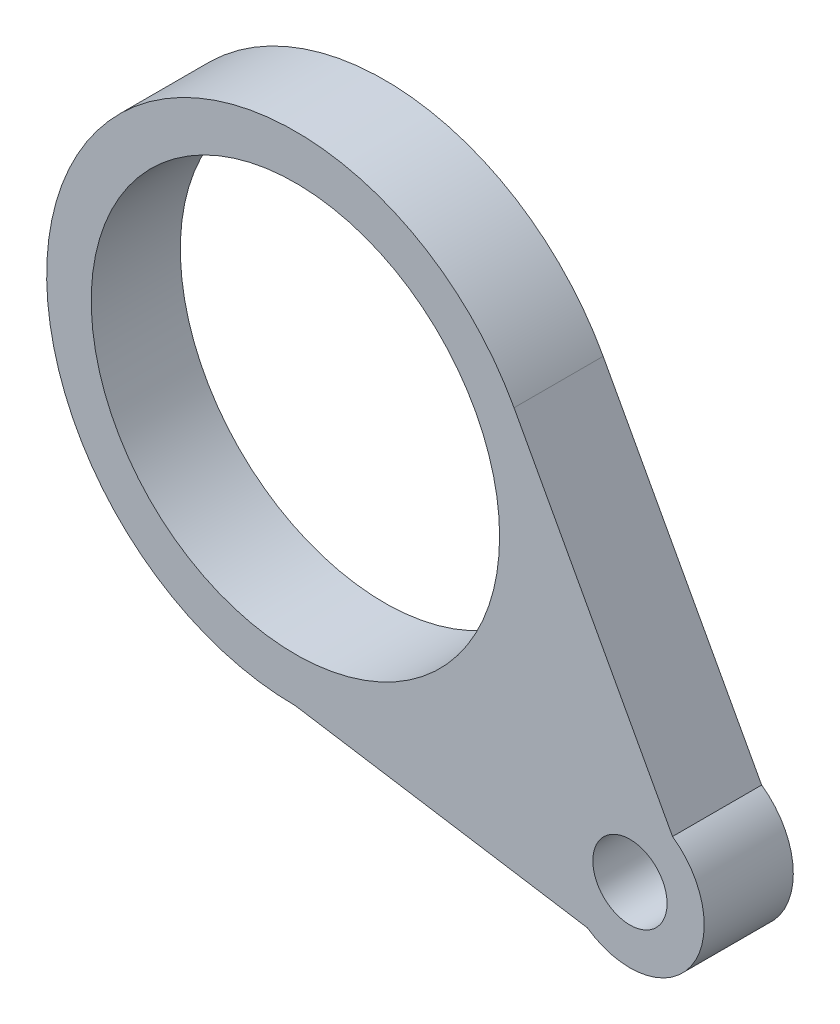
ISO-10303-21;
HEADER;
FILE_DESCRIPTION(('STEP AP214'),'2;1');
FILE_NAME('part.step','',(''),(''),'','','');
FILE_SCHEMA(('AUTOMOTIVE_DESIGN { 1 0 10303 214 1 1 1 1 }'));
ENDSEC;
DATA;
#1=APPLICATION_CONTEXT('core data for automotive mechanical design processes');
#2=APPLICATION_PROTOCOL_DEFINITION('international standard','automotive_design',2000,#1);
#3=PRODUCT_CONTEXT('',#1,'mechanical');
#4=PRODUCT('Part','Part','',(#3));
#5=PRODUCT_RELATED_PRODUCT_CATEGORY('part','',(#4));
#6=PRODUCT_DEFINITION_FORMATION('','',#4);
#7=PRODUCT_DEFINITION_CONTEXT('part definition',#1,'design');
#8=PRODUCT_DEFINITION('design','',#6,#7);
#9=PRODUCT_DEFINITION_SHAPE('','',#8);
#10=(LENGTH_UNIT() NAMED_UNIT(*) SI_UNIT(.MILLI.,.METRE.));
#11=(NAMED_UNIT(*) PLANE_ANGLE_UNIT() SI_UNIT($,.RADIAN.));
#12=(NAMED_UNIT(*) SI_UNIT($,.STERADIAN.) SOLID_ANGLE_UNIT());
#13=UNCERTAINTY_MEASURE_WITH_UNIT(LENGTH_MEASURE(1.E-05),#10,'distance_accuracy_value','');
#14=(GEOMETRIC_REPRESENTATION_CONTEXT(3) GLOBAL_UNCERTAINTY_ASSIGNED_CONTEXT((#13)) GLOBAL_UNIT_ASSIGNED_CONTEXT((#10,
#11,#12)) REPRESENTATION_CONTEXT('',''));
#15=CARTESIAN_POINT('',(0.,0.,0.));
#16=DIRECTION('',(0.,0.,1.));
#17=DIRECTION('',(1.,0.,0.));
#18=AXIS2_PLACEMENT_3D('',#15,#16,#17);
#19=CARTESIAN_POINT('',(0.,0.,12.));
#20=DIRECTION('',(0.,0.,-1.));
#21=DIRECTION('',(-1.,0.,0.));
#22=AXIS2_PLACEMENT_3D('',#19,#20,#21);
#23=CYLINDRICAL_SURFACE('',#22,33.5);
#24=CARTESIAN_POINT('',(0.,0.,0.));
#25=DIRECTION('',(0.,0.,1.));
#26=DIRECTION('',(1.,0.,0.));
#27=AXIS2_PLACEMENT_3D('',#24,#25,#26);
#28=CIRCLE('',#27,33.5);
#29=CARTESIAN_POINT('',(29.4438643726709,15.9783869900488,0.));
#30=VERTEX_POINT('',#29);
#31=CARTESIAN_POINT('',(0.,-33.5,0.));
#32=VERTEX_POINT('',#31);
#33=EDGE_CURVE('E125',#30,#32,#28,.T.);
#34=ORIENTED_EDGE('',*,*,#33,.T.);
#35=DIRECTION('',(0.,0.,-1.));
#36=VECTOR('',#35,1.);
#37=CARTESIAN_POINT('',(0.,-33.5,12.));
#38=LINE('',#37,#36);
#39=CARTESIAN_POINT('',(0.,-33.5,12.));
#40=VERTEX_POINT('',#39);
#41=EDGE_CURVE('E51',#40,#32,#38,.T.);
#42=ORIENTED_EDGE('',*,*,#41,.F.);
#43=CARTESIAN_POINT('',(0.,0.,12.));
#44=DIRECTION('',(0.,0.,1.));
#45=DIRECTION('',(1.,0.,0.));
#46=AXIS2_PLACEMENT_3D('',#43,#44,#45);
#47=CIRCLE('',#46,33.5);
#48=CARTESIAN_POINT('',(29.4438643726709,15.9783869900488,12.));
#49=VERTEX_POINT('',#48);
#50=EDGE_CURVE('E86',#49,#40,#47,.T.);
#51=ORIENTED_EDGE('',*,*,#50,.F.);
#52=DIRECTION('',(0.,0.,-1.));
#53=VECTOR('',#52,1.);
#54=CARTESIAN_POINT('',(29.4438643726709,15.9783869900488,12.));
#55=LINE('',#54,#53);
#56=EDGE_CURVE('E120',#49,#30,#55,.T.);
#57=ORIENTED_EDGE('',*,*,#56,.T.);
#58=EDGE_LOOP('',(#34,#42,#51,#57));
#59=FACE_BOUND('',#58,.T.);
#60=ADVANCED_FACE('F41',(#59),#23,.T.);
#61=CARTESIAN_POINT('',(-5.18467268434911,-32.6773873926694,12.));
#62=DIRECTION('',(-0.15670226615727,-0.987645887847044,0.));
#63=DIRECTION('',(0.987645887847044,-0.15670226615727,0.));
#64=AXIS2_PLACEMENT_3D('',#61,#62,#63);
#65=PLANE('',#64);
#66=DIRECTION('',(-0.987645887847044,0.15670226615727,0.));
#67=VECTOR('',#66,1.);
#68=CARTESIAN_POINT('',(-5.18467268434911,-32.6773873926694,0.));
#69=LINE('',#68,#67);
#70=CARTESIAN_POINT('',(39.317598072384,-39.7382244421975,0.));
#71=VERTEX_POINT('',#70);
#72=EDGE_CURVE('E97',#71,#32,#69,.T.);
#73=ORIENTED_EDGE('',*,*,#72,.F.);
#74=DIRECTION('',(0.,0.,-1.));
#75=VECTOR('',#74,1.);
#76=CARTESIAN_POINT('',(39.317598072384,-39.7382244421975,12.));
#77=LINE('',#76,#75);
#78=CARTESIAN_POINT('',(39.317598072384,-39.7382244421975,12.));
#79=VERTEX_POINT('',#78);
#80=EDGE_CURVE('E92',#79,#71,#77,.T.);
#81=ORIENTED_EDGE('',*,*,#80,.F.);
#82=DIRECTION('',(-0.987645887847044,0.15670226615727,0.));
#83=VECTOR('',#82,1.);
#84=CARTESIAN_POINT('',(-5.18467268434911,-32.6773873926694,12.));
#85=LINE('',#84,#83);
#86=EDGE_CURVE('E95',#79,#40,#85,.T.);
#87=ORIENTED_EDGE('',*,*,#86,.T.);
#88=ORIENTED_EDGE('',*,*,#41,.T.);
#89=EDGE_LOOP('',(#73,#81,#87,#88));
#90=FACE_BOUND('',#89,.T.);
#91=ADVANCED_FACE('F94',(#90),#65,.T.);
#92=CARTESIAN_POINT('',(45.0533624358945,-31.5467039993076,12.));
#93=DIRECTION('',(0.,0.,-1.));
#94=DIRECTION('',(-1.,0.,0.));
#95=AXIS2_PLACEMENT_3D('',#92,#93,#94);
#96=CYLINDRICAL_SURFACE('',#95,10.);
#97=CARTESIAN_POINT('',(45.0533624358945,-31.5467039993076,0.));
#98=DIRECTION('',(0.,0.,1.));
#99=DIRECTION('',(1.,0.,0.));
#100=AXIS2_PLACEMENT_3D('',#97,#98,#99);
#101=CIRCLE('',#100,10.);
#102=CARTESIAN_POINT('',(50.789126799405,-23.3551835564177,0.));
#103=VERTEX_POINT('',#102);
#104=EDGE_CURVE('E75',#71,#103,#101,.T.);
#105=ORIENTED_EDGE('',*,*,#104,.T.);
#106=DIRECTION('',(0.,0.,-1.));
#107=VECTOR('',#106,1.);
#108=CARTESIAN_POINT('',(50.789126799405,-23.3551835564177,12.));
#109=LINE('',#108,#107);
#110=CARTESIAN_POINT('',(50.789126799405,-23.3551835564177,12.));
#111=VERTEX_POINT('',#110);
#112=EDGE_CURVE('E99',#111,#103,#109,.T.);
#113=ORIENTED_EDGE('',*,*,#112,.F.);
#114=CARTESIAN_POINT('',(45.0533624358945,-31.5467039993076,12.));
#115=DIRECTION('',(0.,0.,1.));
#116=DIRECTION('',(1.,0.,0.));
#117=AXIS2_PLACEMENT_3D('',#114,#115,#116);
#118=CIRCLE('',#117,10.);
#119=EDGE_CURVE('E101',#79,#111,#118,.T.);
#120=ORIENTED_EDGE('',*,*,#119,.F.);
#121=ORIENTED_EDGE('',*,*,#80,.T.);
#122=EDGE_LOOP('',(#105,#113,#120,#121));
#123=FACE_BOUND('',#122,.T.);
#124=ADVANCED_FACE('F102',(#123),#96,.T.);
#125=CARTESIAN_POINT('',(29.4438643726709,15.9783869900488,12.));
#126=DIRECTION('',(-0.878921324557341,-0.476966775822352,0.));
#127=DIRECTION('',(0.476966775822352,-0.878921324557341,0.));
#128=AXIS2_PLACEMENT_3D('',#125,#126,#127);
#129=PLANE('',#128);
#130=DIRECTION('',(-0.476966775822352,0.878921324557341,0.));
#131=VECTOR('',#130,1.);
#132=CARTESIAN_POINT('',(29.4438643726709,15.9783869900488,0.));
#133=LINE('',#132,#131);
#134=EDGE_CURVE('E81',#103,#30,#133,.T.);
#135=ORIENTED_EDGE('',*,*,#134,.T.);
#136=ORIENTED_EDGE('',*,*,#56,.F.);
#137=DIRECTION('',(-0.476966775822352,0.878921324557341,0.));
#138=VECTOR('',#137,1.);
#139=CARTESIAN_POINT('',(29.4438643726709,15.9783869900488,12.));
#140=LINE('',#139,#138);
#141=EDGE_CURVE('E59',#111,#49,#140,.T.);
#142=ORIENTED_EDGE('',*,*,#141,.F.);
#143=ORIENTED_EDGE('',*,*,#112,.T.);
#144=EDGE_LOOP('',(#135,#136,#142,#143));
#145=FACE_BOUND('',#144,.T.);
#146=ADVANCED_FACE('F165',(#145),#129,.F.);
#147=CARTESIAN_POINT('',(0.,0.,12.));
#148=DIRECTION('',(0.,0.,-1.));
#149=DIRECTION('',(-1.,0.,0.));
#150=AXIS2_PLACEMENT_3D('',#147,#148,#149);
#151=CYLINDRICAL_SURFACE('',#150,27.5);
#152=CARTESIAN_POINT('',(0.,0.,12.));
#153=DIRECTION('',(0.,0.,1.));
#154=DIRECTION('',(1.,0.,0.));
#155=AXIS2_PLACEMENT_3D('',#152,#153,#154);
#156=CIRCLE('',#155,27.5);
#157=CARTESIAN_POINT('',(27.5,0.,12.));
#158=VERTEX_POINT('',#157);
#159=EDGE_CURVE('E110',#158,#158,#156,.T.);
#160=ORIENTED_EDGE('',*,*,#159,.T.);
#161=EDGE_LOOP('',(#160));
#162=FACE_BOUND('',#161,.T.);
#163=CARTESIAN_POINT('',(0.,0.,0.));
#164=DIRECTION('',(0.,0.,1.));
#165=DIRECTION('',(1.,0.,0.));
#166=AXIS2_PLACEMENT_3D('',#163,#164,#165);
#167=CIRCLE('',#166,27.5);
#168=CARTESIAN_POINT('',(27.5,0.,0.));
#169=VERTEX_POINT('',#168);
#170=EDGE_CURVE('E121',#169,#169,#167,.T.);
#171=ORIENTED_EDGE('',*,*,#170,.F.);
#172=EDGE_LOOP('',(#171));
#173=FACE_BOUND('',#172,.T.);
#174=ADVANCED_FACE('F43',(#162,#173),#151,.F.);
#175=CARTESIAN_POINT('',(45.0533624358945,-31.5467039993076,12.));
#176=DIRECTION('',(0.,0.,-1.));
#177=DIRECTION('',(-1.,0.,0.));
#178=AXIS2_PLACEMENT_3D('',#175,#176,#177);
#179=CYLINDRICAL_SURFACE('',#178,5.);
#180=CARTESIAN_POINT('',(45.0533624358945,-31.5467039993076,12.));
#181=DIRECTION('',(0.,0.,1.));
#182=DIRECTION('',(1.,0.,0.));
#183=AXIS2_PLACEMENT_3D('',#180,#181,#182);
#184=CIRCLE('',#183,5.);
#185=CARTESIAN_POINT('',(50.0533624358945,-31.5467039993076,12.));
#186=VERTEX_POINT('',#185);
#187=EDGE_CURVE('E116',#186,#186,#184,.T.);
#188=ORIENTED_EDGE('',*,*,#187,.T.);
#189=EDGE_LOOP('',(#188));
#190=FACE_BOUND('',#189,.T.);
#191=CARTESIAN_POINT('',(45.0533624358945,-31.5467039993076,0.));
#192=DIRECTION('',(0.,0.,1.));
#193=DIRECTION('',(1.,0.,0.));
#194=AXIS2_PLACEMENT_3D('',#191,#192,#193);
#195=CIRCLE('',#194,5.);
#196=CARTESIAN_POINT('',(50.0533624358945,-31.5467039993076,0.));
#197=VERTEX_POINT('',#196);
#198=EDGE_CURVE('E136',#197,#197,#195,.T.);
#199=ORIENTED_EDGE('',*,*,#198,.F.);
#200=EDGE_LOOP('',(#199));
#201=FACE_BOUND('',#200,.T.);
#202=ADVANCED_FACE('F155',(#190,#201),#179,.F.);
#203=CARTESIAN_POINT('',(0.,0.,12.));
#204=DIRECTION('',(0.,0.,1.));
#205=DIRECTION('',(1.,0.,0.));
#206=AXIS2_PLACEMENT_3D('',#203,#204,#205);
#207=PLANE('',#206);
#208=ORIENTED_EDGE('',*,*,#159,.F.);
#209=EDGE_LOOP('',(#208));
#210=FACE_BOUND('',#209,.T.);
#211=ORIENTED_EDGE('',*,*,#50,.T.);
#212=ORIENTED_EDGE('',*,*,#86,.F.);
#213=ORIENTED_EDGE('',*,*,#119,.T.);
#214=ORIENTED_EDGE('',*,*,#141,.T.);
#215=EDGE_LOOP('',(#211,#212,#213,#214));
#216=FACE_BOUND('',#215,.T.);
#217=ORIENTED_EDGE('',*,*,#187,.F.);
#218=EDGE_LOOP('',(#217));
#219=FACE_BOUND('',#218,.T.);
#220=ADVANCED_FACE('F105',(#210,#216,#219),#207,.T.);
#221=CARTESIAN_POINT('',(0.,0.,0.));
#222=DIRECTION('',(0.,0.,1.));
#223=DIRECTION('',(1.,0.,0.));
#224=AXIS2_PLACEMENT_3D('',#221,#222,#223);
#225=PLANE('',#224);
#226=CARTESIAN_POINT('',(30.5164382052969,-27.8483484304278,0.));
#227=DIRECTION('',(0.,0.,1.));
#228=DIRECTION('',(1.,0.,0.));
#229=AXIS2_PLACEMENT_3D('',#226,#227,#228);
#230=CIRCLE('',#229,1.5);
#231=CARTESIAN_POINT('',(32.0164382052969,-27.8483484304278,0.));
#232=VERTEX_POINT('',#231);
#233=EDGE_CURVE('E11',#232,#232,#230,.F.);
#234=ORIENTED_EDGE('',*,*,#233,.F.);
#235=EDGE_LOOP('',(#234));
#236=FACE_BOUND('',#235,.T.);
#237=ORIENTED_EDGE('',*,*,#170,.T.);
#238=EDGE_LOOP('',(#237));
#239=FACE_BOUND('',#238,.T.);
#240=ORIENTED_EDGE('',*,*,#33,.F.);
#241=ORIENTED_EDGE('',*,*,#134,.F.);
#242=ORIENTED_EDGE('',*,*,#104,.F.);
#243=ORIENTED_EDGE('',*,*,#72,.T.);
#244=EDGE_LOOP('',(#240,#241,#242,#243));
#245=FACE_BOUND('',#244,.T.);
#246=ORIENTED_EDGE('',*,*,#198,.T.);
#247=EDGE_LOOP('',(#246));
#248=FACE_BOUND('',#247,.T.);
#249=ADVANCED_FACE('F147',(#236,#239,#245,#248),#225,.F.);
#250=CARTESIAN_POINT('',(30.5164382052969,-27.8483484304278,-5.));
#251=DIRECTION('',(0.,0.,1.));
#252=DIRECTION('',(1.,0.,0.));
#253=AXIS2_PLACEMENT_3D('',#250,#251,#252);
#254=CYLINDRICAL_SURFACE('',#253,1.5);
#255=CARTESIAN_POINT('',(30.5164382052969,-27.8483484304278,-5.));
#256=DIRECTION('',(0.,0.,-1.));
#257=DIRECTION('',(-1.,0.,0.));
#258=AXIS2_PLACEMENT_3D('',#255,#256,#257);
#259=CIRCLE('',#258,1.5);
#260=CARTESIAN_POINT('',(29.0164382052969,-27.8483484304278,-5.));
#261=VERTEX_POINT('',#260);
#262=EDGE_CURVE('E126',#261,#261,#259,.T.);
#263=ORIENTED_EDGE('',*,*,#262,.F.);
#264=EDGE_LOOP('',(#263));
#265=FACE_BOUND('',#264,.T.);
#266=ORIENTED_EDGE('',*,*,#233,.T.);
#267=EDGE_LOOP('',(#266));
#268=FACE_BOUND('',#267,.T.);
#269=ADVANCED_FACE('F150',(#265,#268),#254,.T.);
#270=CARTESIAN_POINT('',(30.5164382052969,-27.8483484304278,-5.));
#271=DIRECTION('',(0.,0.,-1.));
#272=DIRECTION('',(-1.,0.,0.));
#273=AXIS2_PLACEMENT_3D('',#270,#271,#272);
#274=PLANE('',#273);
#275=ORIENTED_EDGE('',*,*,#262,.T.);
#276=EDGE_LOOP('',(#275));
#277=FACE_BOUND('',#276,.T.);
#278=ADVANCED_FACE('F213',(#277),#274,.T.);
#279=CLOSED_SHELL('',(#60,#91,#124,#146,#174,#202,#220,#249,#269,#278));
#280=MANIFOLD_SOLID_BREP('B2',#279);
#281=ADVANCED_BREP_SHAPE_REPRESENTATION('',(#18,#280),#14);
#282=SHAPE_DEFINITION_REPRESENTATION(#9,#281);
ENDSEC;
END-ISO-10303-21;
